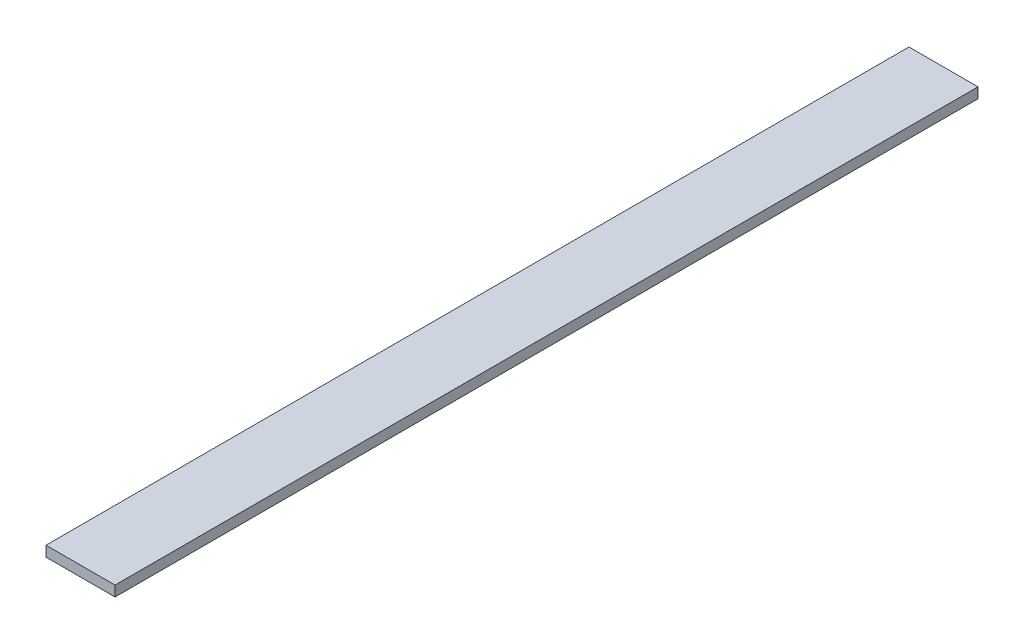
ISO-10303-21;
HEADER;
FILE_DESCRIPTION(('STEP AP214'),'2;1');
FILE_NAME('part.step','',(''),(''),'','','');
FILE_SCHEMA(('AUTOMOTIVE_DESIGN { 1 0 10303 214 1 1 1 1 }'));
ENDSEC;
DATA;
#1=APPLICATION_CONTEXT('core data for automotive mechanical design processes');
#2=APPLICATION_PROTOCOL_DEFINITION('international standard','automotive_design',2000,#1);
#3=PRODUCT_CONTEXT('',#1,'mechanical');
#4=PRODUCT('Part','Part','',(#3));
#5=PRODUCT_RELATED_PRODUCT_CATEGORY('part','',(#4));
#6=PRODUCT_DEFINITION_FORMATION('','',#4);
#7=PRODUCT_DEFINITION_CONTEXT('part definition',#1,'design');
#8=PRODUCT_DEFINITION('design','',#6,#7);
#9=PRODUCT_DEFINITION_SHAPE('','',#8);
#10=(LENGTH_UNIT() NAMED_UNIT(*) SI_UNIT(.MILLI.,.METRE.));
#11=(NAMED_UNIT(*) PLANE_ANGLE_UNIT() SI_UNIT($,.RADIAN.));
#12=(NAMED_UNIT(*) SI_UNIT($,.STERADIAN.) SOLID_ANGLE_UNIT());
#13=UNCERTAINTY_MEASURE_WITH_UNIT(LENGTH_MEASURE(1.E-05),#10,'distance_accuracy_value','');
#14=(GEOMETRIC_REPRESENTATION_CONTEXT(3) GLOBAL_UNCERTAINTY_ASSIGNED_CONTEXT((#13)) GLOBAL_UNIT_ASSIGNED_CONTEXT((#10,
#11,#12)) REPRESENTATION_CONTEXT('',''));
#15=CARTESIAN_POINT('',(0.,0.,0.));
#16=DIRECTION('',(0.,0.,1.));
#17=DIRECTION('',(1.,0.,0.));
#18=AXIS2_PLACEMENT_3D('',#15,#16,#17);
#19=CARTESIAN_POINT('',(20.,0.,0.));
#20=DIRECTION('',(-1.,0.,0.));
#21=DIRECTION('',(0.,0.,1.));
#22=AXIS2_PLACEMENT_3D('',#19,#20,#21);
#23=PLANE('',#22);
#24=DIRECTION('',(0.,-1.,0.));
#25=VECTOR('',#24,1.);
#26=CARTESIAN_POINT('',(20.,3.,0.));
#27=LINE('',#26,#25);
#28=CARTESIAN_POINT('',(20.,6.,0.));
#29=VERTEX_POINT('',#28);
#30=CARTESIAN_POINT('',(20.,0.,0.));
#31=VERTEX_POINT('',#30);
#32=EDGE_CURVE('E51',#29,#31,#27,.T.);
#33=ORIENTED_EDGE('',*,*,#32,.F.);
#34=DIRECTION('',(0.,0.,-1.));
#35=VECTOR('',#34,1.);
#36=CARTESIAN_POINT('',(20.,6.,250.));
#37=LINE('',#36,#35);
#38=CARTESIAN_POINT('',(20.,6.,500.));
#39=VERTEX_POINT('',#38);
#40=EDGE_CURVE('E66',#39,#29,#37,.T.);
#41=ORIENTED_EDGE('',*,*,#40,.F.);
#42=DIRECTION('',(0.,-1.,0.));
#43=VECTOR('',#42,1.);
#44=CARTESIAN_POINT('',(20.,3.,500.));
#45=LINE('',#44,#43);
#46=CARTESIAN_POINT('',(20.,0.,500.));
#47=VERTEX_POINT('',#46);
#48=EDGE_CURVE('E18',#39,#47,#45,.T.);
#49=ORIENTED_EDGE('',*,*,#48,.T.);
#50=DIRECTION('',(0.,0.,1.));
#51=VECTOR('',#50,1.);
#52=CARTESIAN_POINT('',(20.,0.,250.));
#53=LINE('',#52,#51);
#54=EDGE_CURVE('E56',#31,#47,#53,.T.);
#55=ORIENTED_EDGE('',*,*,#54,.F.);
#56=EDGE_LOOP('',(#33,#41,#49,#55));
#57=FACE_BOUND('',#56,.T.);
#58=ADVANCED_FACE('F14',(#57),#23,.F.);
#59=CARTESIAN_POINT('',(20.,0.,500.));
#60=DIRECTION('',(0.,0.,-1.));
#61=DIRECTION('',(-1.,0.,0.));
#62=AXIS2_PLACEMENT_3D('',#59,#60,#61);
#63=PLANE('',#62);
#64=DIRECTION('',(-1.,0.,0.));
#65=VECTOR('',#64,1.);
#66=CARTESIAN_POINT('',(0.,0.,500.));
#67=LINE('',#66,#65);
#68=CARTESIAN_POINT('',(-20.,0.,500.));
#69=VERTEX_POINT('',#68);
#70=EDGE_CURVE('E61',#47,#69,#67,.T.);
#71=ORIENTED_EDGE('',*,*,#70,.F.);
#72=ORIENTED_EDGE('',*,*,#48,.F.);
#73=DIRECTION('',(1.,0.,0.));
#74=VECTOR('',#73,1.);
#75=CARTESIAN_POINT('',(0.,6.,500.));
#76=LINE('',#75,#74);
#77=CARTESIAN_POINT('',(-20.,6.,500.));
#78=VERTEX_POINT('',#77);
#79=EDGE_CURVE('E79',#78,#39,#76,.T.);
#80=ORIENTED_EDGE('',*,*,#79,.F.);
#81=DIRECTION('',(0.,-1.,0.));
#82=VECTOR('',#81,1.);
#83=CARTESIAN_POINT('',(-20.,3.,500.));
#84=LINE('',#83,#82);
#85=EDGE_CURVE('E72',#78,#69,#84,.T.);
#86=ORIENTED_EDGE('',*,*,#85,.T.);
#87=EDGE_LOOP('',(#71,#72,#80,#86));
#88=FACE_BOUND('',#87,.T.);
#89=ADVANCED_FACE('F71',(#88),#63,.F.);
#90=CARTESIAN_POINT('',(-20.,0.,500.));
#91=DIRECTION('',(0.,-1.,0.));
#92=DIRECTION('',(0.,0.,-1.));
#93=AXIS2_PLACEMENT_3D('',#90,#91,#92);
#94=PLANE('',#93);
#95=ORIENTED_EDGE('',*,*,#70,.T.);
#96=DIRECTION('',(0.,0.,-1.));
#97=VECTOR('',#96,1.);
#98=CARTESIAN_POINT('',(-20.,0.,250.));
#99=LINE('',#98,#97);
#100=CARTESIAN_POINT('',(-20.,0.,0.));
#101=VERTEX_POINT('',#100);
#102=EDGE_CURVE('E82',#69,#101,#99,.T.);
#103=ORIENTED_EDGE('',*,*,#102,.T.);
#104=DIRECTION('',(-1.,0.,0.));
#105=VECTOR('',#104,1.);
#106=CARTESIAN_POINT('',(0.,0.,0.));
#107=LINE('',#106,#105);
#108=EDGE_CURVE('E63',#31,#101,#107,.T.);
#109=ORIENTED_EDGE('',*,*,#108,.F.);
#110=ORIENTED_EDGE('',*,*,#54,.T.);
#111=EDGE_LOOP('',(#95,#103,#109,#110));
#112=FACE_BOUND('',#111,.T.);
#113=ADVANCED_FACE('F58',(#112),#94,.T.);
#114=CARTESIAN_POINT('',(20.,0.,0.));
#115=DIRECTION('',(0.,0.,-1.));
#116=DIRECTION('',(-1.,0.,0.));
#117=AXIS2_PLACEMENT_3D('',#114,#115,#116);
#118=PLANE('',#117);
#119=ORIENTED_EDGE('',*,*,#32,.T.);
#120=ORIENTED_EDGE('',*,*,#108,.T.);
#121=DIRECTION('',(0.,1.,0.));
#122=VECTOR('',#121,1.);
#123=CARTESIAN_POINT('',(-20.,3.,0.));
#124=LINE('',#123,#122);
#125=CARTESIAN_POINT('',(-20.,6.,0.));
#126=VERTEX_POINT('',#125);
#127=EDGE_CURVE('E24',#101,#126,#124,.T.);
#128=ORIENTED_EDGE('',*,*,#127,.T.);
#129=DIRECTION('',(-1.,0.,0.));
#130=VECTOR('',#129,1.);
#131=CARTESIAN_POINT('',(0.,6.,0.));
#132=LINE('',#131,#130);
#133=EDGE_CURVE('E32',#29,#126,#132,.T.);
#134=ORIENTED_EDGE('',*,*,#133,.F.);
#135=EDGE_LOOP('',(#119,#120,#128,#134));
#136=FACE_BOUND('',#135,.T.);
#137=ADVANCED_FACE('F86',(#136),#118,.T.);
#138=CARTESIAN_POINT('',(20.,6.,0.));
#139=DIRECTION('',(0.,1.,0.));
#140=DIRECTION('',(-1.,0.,0.));
#141=AXIS2_PLACEMENT_3D('',#138,#139,#140);
#142=PLANE('',#141);
#143=DIRECTION('',(0.,0.,1.));
#144=VECTOR('',#143,1.);
#145=CARTESIAN_POINT('',(-20.,6.,250.));
#146=LINE('',#145,#144);
#147=EDGE_CURVE('E9',#126,#78,#146,.T.);
#148=ORIENTED_EDGE('',*,*,#147,.T.);
#149=ORIENTED_EDGE('',*,*,#79,.T.);
#150=ORIENTED_EDGE('',*,*,#40,.T.);
#151=ORIENTED_EDGE('',*,*,#133,.T.);
#152=EDGE_LOOP('',(#148,#149,#150,#151));
#153=FACE_BOUND('',#152,.T.);
#154=ADVANCED_FACE('F88',(#153),#142,.T.);
#155=CARTESIAN_POINT('',(-20.,0.,500.));
#156=DIRECTION('',(1.,0.,0.));
#157=DIRECTION('',(0.,0.,-1.));
#158=AXIS2_PLACEMENT_3D('',#155,#156,#157);
#159=PLANE('',#158);
#160=ORIENTED_EDGE('',*,*,#127,.F.);
#161=ORIENTED_EDGE('',*,*,#102,.F.);
#162=ORIENTED_EDGE('',*,*,#85,.F.);
#163=ORIENTED_EDGE('',*,*,#147,.F.);
#164=EDGE_LOOP('',(#160,#161,#162,#163));
#165=FACE_BOUND('',#164,.T.);
#166=ADVANCED_FACE('F16',(#165),#159,.F.);
#167=CLOSED_SHELL('',(#58,#89,#113,#137,#154,#166));
#168=MANIFOLD_SOLID_BREP('B1',#167);
#169=ADVANCED_BREP_SHAPE_REPRESENTATION('',(#18,#168),#14);
#170=SHAPE_DEFINITION_REPRESENTATION(#9,#169);
ENDSEC;
END-ISO-10303-21;
